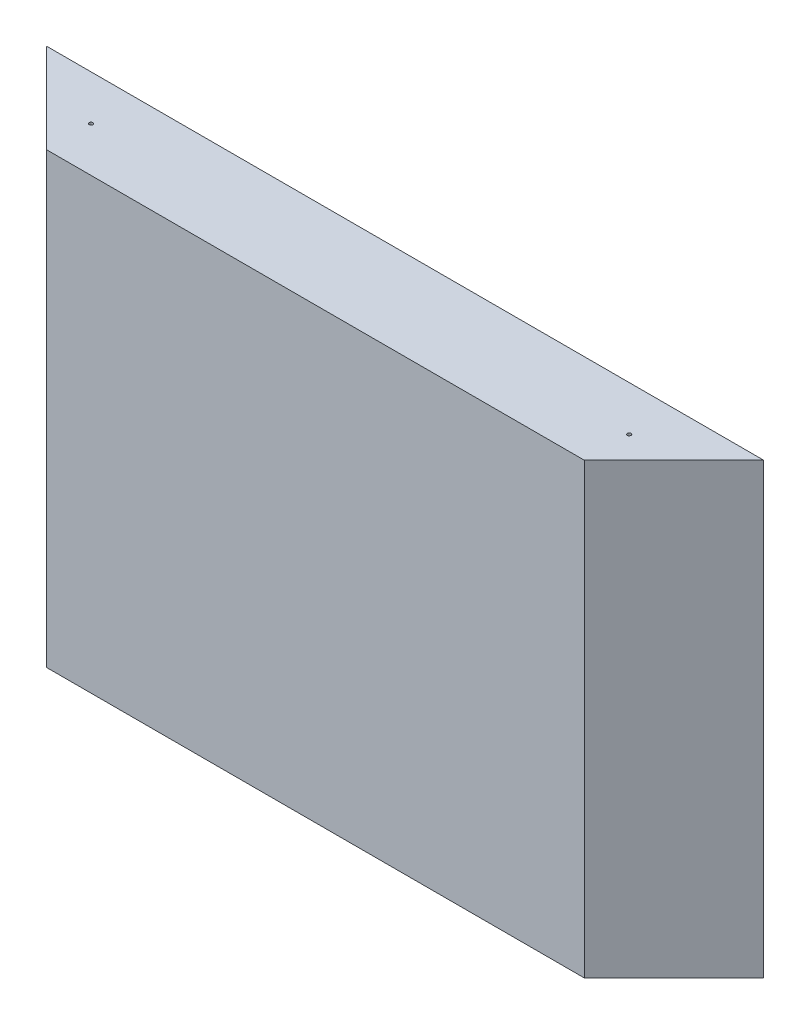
ISO-10303-21;
HEADER;
FILE_DESCRIPTION(('STEP AP214'),'2;1');
FILE_NAME('part.step','',(''),(''),'','','');
FILE_SCHEMA(('AUTOMOTIVE_DESIGN { 1 0 10303 214 1 1 1 1 }'));
ENDSEC;
DATA;
#1=APPLICATION_CONTEXT('core data for automotive mechanical design processes');
#2=APPLICATION_PROTOCOL_DEFINITION('international standard','automotive_design',2000,#1);
#3=PRODUCT_CONTEXT('',#1,'mechanical');
#4=PRODUCT('Part','Part','',(#3));
#5=PRODUCT_RELATED_PRODUCT_CATEGORY('part','',(#4));
#6=PRODUCT_DEFINITION_FORMATION('','',#4);
#7=PRODUCT_DEFINITION_CONTEXT('part definition',#1,'design');
#8=PRODUCT_DEFINITION('design','',#6,#7);
#9=PRODUCT_DEFINITION_SHAPE('','',#8);
#10=(LENGTH_UNIT() NAMED_UNIT(*) SI_UNIT(.MILLI.,.METRE.));
#11=(NAMED_UNIT(*) PLANE_ANGLE_UNIT() SI_UNIT($,.RADIAN.));
#12=(NAMED_UNIT(*) SI_UNIT($,.STERADIAN.) SOLID_ANGLE_UNIT());
#13=UNCERTAINTY_MEASURE_WITH_UNIT(LENGTH_MEASURE(1.E-05),#10,'distance_accuracy_value','');
#14=(GEOMETRIC_REPRESENTATION_CONTEXT(3) GLOBAL_UNCERTAINTY_ASSIGNED_CONTEXT((#13)) GLOBAL_UNIT_ASSIGNED_CONTEXT((#10,
#11,#12)) REPRESENTATION_CONTEXT('',''));
#15=CARTESIAN_POINT('',(0.,0.,0.));
#16=DIRECTION('',(0.,0.,1.));
#17=DIRECTION('',(1.,0.,0.));
#18=AXIS2_PLACEMENT_3D('',#15,#16,#17);
#19=CARTESIAN_POINT('',(-152.4,95.25,38.1));
#20=DIRECTION('',(0.,-1.,0.));
#21=DIRECTION('',(0.,0.,-1.));
#22=AXIS2_PLACEMENT_3D('',#19,#20,#21);
#23=PLANE('',#22);
#24=CARTESIAN_POINT('',(-114.3,95.25,19.05));
#25=DIRECTION('',(0.,1.,0.));
#26=DIRECTION('',(0.,0.,1.));
#27=AXIS2_PLACEMENT_3D('',#24,#25,#26);
#28=CIRCLE('',#27,0.793749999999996);
#29=CARTESIAN_POINT('',(-114.3,95.25,19.84375));
#30=VERTEX_POINT('',#29);
#31=EDGE_CURVE('E96',#30,#30,#28,.T.);
#32=ORIENTED_EDGE('',*,*,#31,.F.);
#33=EDGE_LOOP('',(#32));
#34=FACE_BOUND('',#33,.T.);
#35=CARTESIAN_POINT('',(114.3,95.25,19.05));
#36=DIRECTION('',(0.,1.,0.));
#37=DIRECTION('',(0.,0.,1.));
#38=AXIS2_PLACEMENT_3D('',#35,#36,#37);
#39=CIRCLE('',#38,0.793749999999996);
#40=CARTESIAN_POINT('',(114.3,95.25,19.84375));
#41=VERTEX_POINT('',#40);
#42=EDGE_CURVE('E95',#41,#41,#39,.T.);
#43=ORIENTED_EDGE('',*,*,#42,.F.);
#44=EDGE_LOOP('',(#43));
#45=FACE_BOUND('',#44,.T.);
#46=DIRECTION('',(-1.,0.,0.));
#47=VECTOR('',#46,1.);
#48=CARTESIAN_POINT('',(-152.4,95.25,38.1));
#49=LINE('',#48,#47);
#50=CARTESIAN_POINT('',(114.3,95.25,38.1));
#51=VERTEX_POINT('',#50);
#52=CARTESIAN_POINT('',(-114.3,95.25,38.1));
#53=VERTEX_POINT('',#52);
#54=EDGE_CURVE('E119',#51,#53,#49,.T.);
#55=ORIENTED_EDGE('',*,*,#54,.F.);
#56=DIRECTION('',(-0.707106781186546,0.,0.707106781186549));
#57=VECTOR('',#56,1.);
#58=CARTESIAN_POINT('',(114.3,95.25,38.1));
#59=LINE('',#58,#57);
#60=CARTESIAN_POINT('',(152.4,95.25,0.));
#61=VERTEX_POINT('',#60);
#62=EDGE_CURVE('E139',#51,#61,#59,.F.);
#63=ORIENTED_EDGE('',*,*,#62,.T.);
#64=DIRECTION('',(-1.,0.,0.));
#65=VECTOR('',#64,1.);
#66=CARTESIAN_POINT('',(-152.4,95.25,0.));
#67=LINE('',#66,#65);
#68=CARTESIAN_POINT('',(-152.4,95.25,0.));
#69=VERTEX_POINT('',#68);
#70=EDGE_CURVE('E128',#61,#69,#67,.T.);
#71=ORIENTED_EDGE('',*,*,#70,.T.);
#72=DIRECTION('',(-0.707106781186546,0.,-0.707106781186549));
#73=VECTOR('',#72,1.);
#74=CARTESIAN_POINT('',(-114.3,95.25,38.1));
#75=LINE('',#74,#73);
#76=EDGE_CURVE('E137',#69,#53,#75,.F.);
#77=ORIENTED_EDGE('',*,*,#76,.T.);
#78=EDGE_LOOP('',(#55,#63,#71,#77));
#79=FACE_BOUND('',#78,.T.);
#80=ADVANCED_FACE('F35',(#34,#45,#79),#23,.F.);
#81=CARTESIAN_POINT('',(-152.4,-95.25,38.1));
#82=DIRECTION('',(0.,1.,0.));
#83=DIRECTION('',(0.,0.,1.));
#84=AXIS2_PLACEMENT_3D('',#81,#82,#83);
#85=PLANE('',#84);
#86=CARTESIAN_POINT('',(-101.6,-95.25,19.05));
#87=DIRECTION('',(0.,-1.,0.));
#88=DIRECTION('',(0.,0.,-1.));
#89=AXIS2_PLACEMENT_3D('',#86,#87,#88);
#90=CIRCLE('',#89,0.793749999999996);
#91=CARTESIAN_POINT('',(-101.6,-95.25,18.25625));
#92=VERTEX_POINT('',#91);
#93=EDGE_CURVE('E106',#92,#92,#90,.T.);
#94=ORIENTED_EDGE('',*,*,#93,.F.);
#95=EDGE_LOOP('',(#94));
#96=FACE_BOUND('',#95,.T.);
#97=CARTESIAN_POINT('',(101.6,-95.25,19.05));
#98=DIRECTION('',(0.,-1.,0.));
#99=DIRECTION('',(0.,0.,-1.));
#100=AXIS2_PLACEMENT_3D('',#97,#98,#99);
#101=CIRCLE('',#100,0.793749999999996);
#102=CARTESIAN_POINT('',(101.6,-95.25,18.25625));
#103=VERTEX_POINT('',#102);
#104=EDGE_CURVE('E112',#103,#103,#101,.T.);
#105=ORIENTED_EDGE('',*,*,#104,.F.);
#106=EDGE_LOOP('',(#105));
#107=FACE_BOUND('',#106,.T.);
#108=DIRECTION('',(1.,0.,0.));
#109=VECTOR('',#108,1.);
#110=CARTESIAN_POINT('',(-152.4,-95.25,0.));
#111=LINE('',#110,#109);
#112=CARTESIAN_POINT('',(-152.4,-95.25,0.));
#113=VERTEX_POINT('',#112);
#114=CARTESIAN_POINT('',(152.4,-95.25,0.));
#115=VERTEX_POINT('',#114);
#116=EDGE_CURVE('E123',#113,#115,#111,.T.);
#117=ORIENTED_EDGE('',*,*,#116,.T.);
#118=DIRECTION('',(0.707106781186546,0.,-0.707106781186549));
#119=VECTOR('',#118,1.);
#120=CARTESIAN_POINT('',(114.3,-95.25,38.1));
#121=LINE('',#120,#119);
#122=CARTESIAN_POINT('',(114.3,-95.25,38.1));
#123=VERTEX_POINT('',#122);
#124=EDGE_CURVE('E11',#115,#123,#121,.F.);
#125=ORIENTED_EDGE('',*,*,#124,.T.);
#126=DIRECTION('',(1.,0.,0.));
#127=VECTOR('',#126,1.);
#128=CARTESIAN_POINT('',(-152.4,-95.25,38.1));
#129=LINE('',#128,#127);
#130=CARTESIAN_POINT('',(-114.3,-95.25,38.1));
#131=VERTEX_POINT('',#130);
#132=EDGE_CURVE('E122',#131,#123,#129,.T.);
#133=ORIENTED_EDGE('',*,*,#132,.F.);
#134=DIRECTION('',(0.707106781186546,0.,0.707106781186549));
#135=VECTOR('',#134,1.);
#136=CARTESIAN_POINT('',(-114.3,-95.25,38.1));
#137=LINE('',#136,#135);
#138=EDGE_CURVE('E43',#131,#113,#137,.F.);
#139=ORIENTED_EDGE('',*,*,#138,.T.);
#140=EDGE_LOOP('',(#117,#125,#133,#139));
#141=FACE_BOUND('',#140,.T.);
#142=ADVANCED_FACE('F141',(#96,#107,#141),#85,.F.);
#143=CARTESIAN_POINT('',(0.,0.,38.1));
#144=DIRECTION('',(0.,0.,-1.));
#145=DIRECTION('',(-1.,0.,0.));
#146=AXIS2_PLACEMENT_3D('',#143,#144,#145);
#147=PLANE('',#146);
#148=ORIENTED_EDGE('',*,*,#132,.T.);
#149=DIRECTION('',(0.,1.,0.));
#150=VECTOR('',#149,1.);
#151=CARTESIAN_POINT('',(114.3,0.,38.1));
#152=LINE('',#151,#150);
#153=EDGE_CURVE('E134',#123,#51,#152,.T.);
#154=ORIENTED_EDGE('',*,*,#153,.T.);
#155=ORIENTED_EDGE('',*,*,#54,.T.);
#156=DIRECTION('',(0.,-1.,0.));
#157=VECTOR('',#156,1.);
#158=CARTESIAN_POINT('',(-114.3,0.,38.1));
#159=LINE('',#158,#157);
#160=EDGE_CURVE('E125',#53,#131,#159,.T.);
#161=ORIENTED_EDGE('',*,*,#160,.T.);
#162=EDGE_LOOP('',(#148,#154,#155,#161));
#163=FACE_BOUND('',#162,.T.);
#164=ADVANCED_FACE('F151',(#163),#147,.F.);
#165=CARTESIAN_POINT('',(0.,0.,0.));
#166=DIRECTION('',(0.,0.,-1.));
#167=DIRECTION('',(-1.,0.,0.));
#168=AXIS2_PLACEMENT_3D('',#165,#166,#167);
#169=PLANE('',#168);
#170=DIRECTION('',(0.,1.,0.));
#171=VECTOR('',#170,1.);
#172=CARTESIAN_POINT('',(152.4,-95.25,0.));
#173=LINE('',#172,#171);
#174=EDGE_CURVE('E118',#115,#61,#173,.T.);
#175=ORIENTED_EDGE('',*,*,#174,.F.);
#176=ORIENTED_EDGE('',*,*,#116,.F.);
#177=DIRECTION('',(0.,-1.,0.));
#178=VECTOR('',#177,1.);
#179=CARTESIAN_POINT('',(-152.4,-95.25,0.));
#180=LINE('',#179,#178);
#181=EDGE_CURVE('E130',#69,#113,#180,.T.);
#182=ORIENTED_EDGE('',*,*,#181,.F.);
#183=ORIENTED_EDGE('',*,*,#70,.F.);
#184=EDGE_LOOP('',(#175,#176,#182,#183));
#185=FACE_BOUND('',#184,.T.);
#186=ADVANCED_FACE('F145',(#185),#169,.T.);
#187=CARTESIAN_POINT('',(101.6,-44.45,19.05));
#188=DIRECTION('',(0.,-1.,0.));
#189=DIRECTION('',(0.,0.,-1.));
#190=AXIS2_PLACEMENT_3D('',#187,#188,#189);
#191=CONICAL_SURFACE('',#190,0.793749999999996,1.02974425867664);
#192=CARTESIAN_POINT('',(101.6,-43.9730668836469,19.05));
#193=VERTEX_POINT('',#192);
#194=VERTEX_LOOP('',#193);
#195=FACE_BOUND('',#194,.T.);
#196=CARTESIAN_POINT('',(101.6,-44.45,19.05));
#197=DIRECTION('',(0.,-1.,0.));
#198=DIRECTION('',(0.,0.,-1.));
#199=AXIS2_PLACEMENT_3D('',#196,#197,#198);
#200=CIRCLE('',#199,0.793749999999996);
#201=CARTESIAN_POINT('',(101.6,-44.45,18.25625));
#202=VERTEX_POINT('',#201);
#203=EDGE_CURVE('E115',#202,#202,#200,.T.);
#204=ORIENTED_EDGE('',*,*,#203,.T.);
#205=EDGE_LOOP('',(#204));
#206=FACE_BOUND('',#205,.T.);
#207=ADVANCED_FACE('F174',(#195,#206),#191,.F.);
#208=CARTESIAN_POINT('',(101.6,-95.25,19.05));
#209=DIRECTION('',(0.,-1.,0.));
#210=DIRECTION('',(0.,0.,-1.));
#211=AXIS2_PLACEMENT_3D('',#208,#209,#210);
#212=CYLINDRICAL_SURFACE('',#211,0.793749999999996);
#213=ORIENTED_EDGE('',*,*,#203,.F.);
#214=EDGE_LOOP('',(#213));
#215=FACE_BOUND('',#214,.T.);
#216=ORIENTED_EDGE('',*,*,#104,.T.);
#217=EDGE_LOOP('',(#216));
#218=FACE_BOUND('',#217,.T.);
#219=ADVANCED_FACE('F179',(#215,#218),#212,.F.);
#220=CARTESIAN_POINT('',(-101.6,-44.45,19.05));
#221=DIRECTION('',(0.,-1.,0.));
#222=DIRECTION('',(0.,0.,-1.));
#223=AXIS2_PLACEMENT_3D('',#220,#221,#222);
#224=CONICAL_SURFACE('',#223,0.793749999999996,1.02974425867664);
#225=CARTESIAN_POINT('',(-101.6,-43.9730668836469,19.05));
#226=VERTEX_POINT('',#225);
#227=VERTEX_LOOP('',#226);
#228=FACE_BOUND('',#227,.T.);
#229=CARTESIAN_POINT('',(-101.6,-44.45,19.05));
#230=DIRECTION('',(0.,-1.,0.));
#231=DIRECTION('',(0.,0.,-1.));
#232=AXIS2_PLACEMENT_3D('',#229,#230,#231);
#233=CIRCLE('',#232,0.793749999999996);
#234=CARTESIAN_POINT('',(-101.6,-44.45,18.25625));
#235=VERTEX_POINT('',#234);
#236=EDGE_CURVE('E109',#235,#235,#233,.T.);
#237=ORIENTED_EDGE('',*,*,#236,.T.);
#238=EDGE_LOOP('',(#237));
#239=FACE_BOUND('',#238,.T.);
#240=ADVANCED_FACE('F183',(#228,#239),#224,.F.);
#241=CARTESIAN_POINT('',(-101.6,-95.25,19.05));
#242=DIRECTION('',(0.,-1.,0.));
#243=DIRECTION('',(0.,0.,-1.));
#244=AXIS2_PLACEMENT_3D('',#241,#242,#243);
#245=CYLINDRICAL_SURFACE('',#244,0.793749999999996);
#246=ORIENTED_EDGE('',*,*,#236,.F.);
#247=EDGE_LOOP('',(#246));
#248=FACE_BOUND('',#247,.T.);
#249=ORIENTED_EDGE('',*,*,#93,.T.);
#250=EDGE_LOOP('',(#249));
#251=FACE_BOUND('',#250,.T.);
#252=ADVANCED_FACE('F187',(#248,#251),#245,.F.);
#253=CARTESIAN_POINT('',(114.3,69.85,19.05));
#254=DIRECTION('',(0.,1.,0.));
#255=DIRECTION('',(0.,0.,1.));
#256=AXIS2_PLACEMENT_3D('',#253,#254,#255);
#257=CONICAL_SURFACE('',#256,0.793749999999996,1.02974425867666);
#258=CARTESIAN_POINT('',(114.3,69.3730668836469,19.05));
#259=VERTEX_POINT('',#258);
#260=VERTEX_LOOP('',#259);
#261=FACE_BOUND('',#260,.T.);
#262=CARTESIAN_POINT('',(114.3,69.85,19.05));
#263=DIRECTION('',(0.,1.,0.));
#264=DIRECTION('',(0.,0.,1.));
#265=AXIS2_PLACEMENT_3D('',#262,#263,#264);
#266=CIRCLE('',#265,0.793749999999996);
#267=CARTESIAN_POINT('',(114.3,69.85,19.84375));
#268=VERTEX_POINT('',#267);
#269=EDGE_CURVE('E99',#268,#268,#266,.T.);
#270=ORIENTED_EDGE('',*,*,#269,.T.);
#271=EDGE_LOOP('',(#270));
#272=FACE_BOUND('',#271,.T.);
#273=ADVANCED_FACE('F191',(#261,#272),#257,.F.);
#274=CARTESIAN_POINT('',(114.3,95.25,19.05));
#275=DIRECTION('',(0.,1.,0.));
#276=DIRECTION('',(0.,0.,1.));
#277=AXIS2_PLACEMENT_3D('',#274,#275,#276);
#278=CYLINDRICAL_SURFACE('',#277,0.793749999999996);
#279=ORIENTED_EDGE('',*,*,#269,.F.);
#280=EDGE_LOOP('',(#279));
#281=FACE_BOUND('',#280,.T.);
#282=ORIENTED_EDGE('',*,*,#42,.T.);
#283=EDGE_LOOP('',(#282));
#284=FACE_BOUND('',#283,.T.);
#285=ADVANCED_FACE('F89',(#281,#284),#278,.F.);
#286=CARTESIAN_POINT('',(-114.3,69.85,19.05));
#287=DIRECTION('',(0.,1.,0.));
#288=DIRECTION('',(0.,0.,1.));
#289=AXIS2_PLACEMENT_3D('',#286,#287,#288);
#290=CONICAL_SURFACE('',#289,0.793749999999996,1.02974425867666);
#291=CARTESIAN_POINT('',(-114.3,69.3730668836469,19.05));
#292=VERTEX_POINT('',#291);
#293=VERTEX_LOOP('',#292);
#294=FACE_BOUND('',#293,.T.);
#295=CARTESIAN_POINT('',(-114.3,69.85,19.05));
#296=DIRECTION('',(0.,1.,0.));
#297=DIRECTION('',(0.,0.,1.));
#298=AXIS2_PLACEMENT_3D('',#295,#296,#297);
#299=CIRCLE('',#298,0.793749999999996);
#300=CARTESIAN_POINT('',(-114.3,69.85,19.84375));
#301=VERTEX_POINT('',#300);
#302=EDGE_CURVE('E93',#301,#301,#299,.T.);
#303=ORIENTED_EDGE('',*,*,#302,.T.);
#304=EDGE_LOOP('',(#303));
#305=FACE_BOUND('',#304,.T.);
#306=ADVANCED_FACE('F85',(#294,#305),#290,.F.);
#307=CARTESIAN_POINT('',(-114.3,95.25,19.05));
#308=DIRECTION('',(0.,1.,0.));
#309=DIRECTION('',(0.,0.,1.));
#310=AXIS2_PLACEMENT_3D('',#307,#308,#309);
#311=CYLINDRICAL_SURFACE('',#310,0.793749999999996);
#312=ORIENTED_EDGE('',*,*,#302,.F.);
#313=EDGE_LOOP('',(#312));
#314=FACE_BOUND('',#313,.T.);
#315=ORIENTED_EDGE('',*,*,#31,.T.);
#316=EDGE_LOOP('',(#315));
#317=FACE_BOUND('',#316,.T.);
#318=ADVANCED_FACE('F88',(#314,#317),#311,.F.);
#319=CARTESIAN_POINT('',(114.3,0.,38.1));
#320=DIRECTION('',(-0.707106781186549,0.,-0.707106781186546));
#321=DIRECTION('',(0.,1.,0.));
#322=AXIS2_PLACEMENT_3D('',#319,#320,#321);
#323=PLANE('',#322);
#324=ORIENTED_EDGE('',*,*,#124,.F.);
#325=ORIENTED_EDGE('',*,*,#174,.T.);
#326=ORIENTED_EDGE('',*,*,#62,.F.);
#327=ORIENTED_EDGE('',*,*,#153,.F.);
#328=EDGE_LOOP('',(#324,#325,#326,#327));
#329=FACE_BOUND('',#328,.T.);
#330=ADVANCED_FACE('F154',(#329),#323,.F.);
#331=CARTESIAN_POINT('',(-114.3,0.,38.1));
#332=DIRECTION('',(0.707106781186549,0.,-0.707106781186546));
#333=DIRECTION('',(0.,-1.,0.));
#334=AXIS2_PLACEMENT_3D('',#331,#332,#333);
#335=PLANE('',#334);
#336=ORIENTED_EDGE('',*,*,#76,.F.);
#337=ORIENTED_EDGE('',*,*,#181,.T.);
#338=ORIENTED_EDGE('',*,*,#138,.F.);
#339=ORIENTED_EDGE('',*,*,#160,.F.);
#340=EDGE_LOOP('',(#336,#337,#338,#339));
#341=FACE_BOUND('',#340,.T.);
#342=ADVANCED_FACE('F37',(#341),#335,.F.);
#343=CLOSED_SHELL('',(#80,#142,#164,#186,#207,#219,#240,#252,#273,#285,#306,#318,#330,#342));
#344=MANIFOLD_SOLID_BREP('B2',#343);
#345=ADVANCED_BREP_SHAPE_REPRESENTATION('',(#18,#344),#14);
#346=SHAPE_DEFINITION_REPRESENTATION(#9,#345);
ENDSEC;
END-ISO-10303-21;
